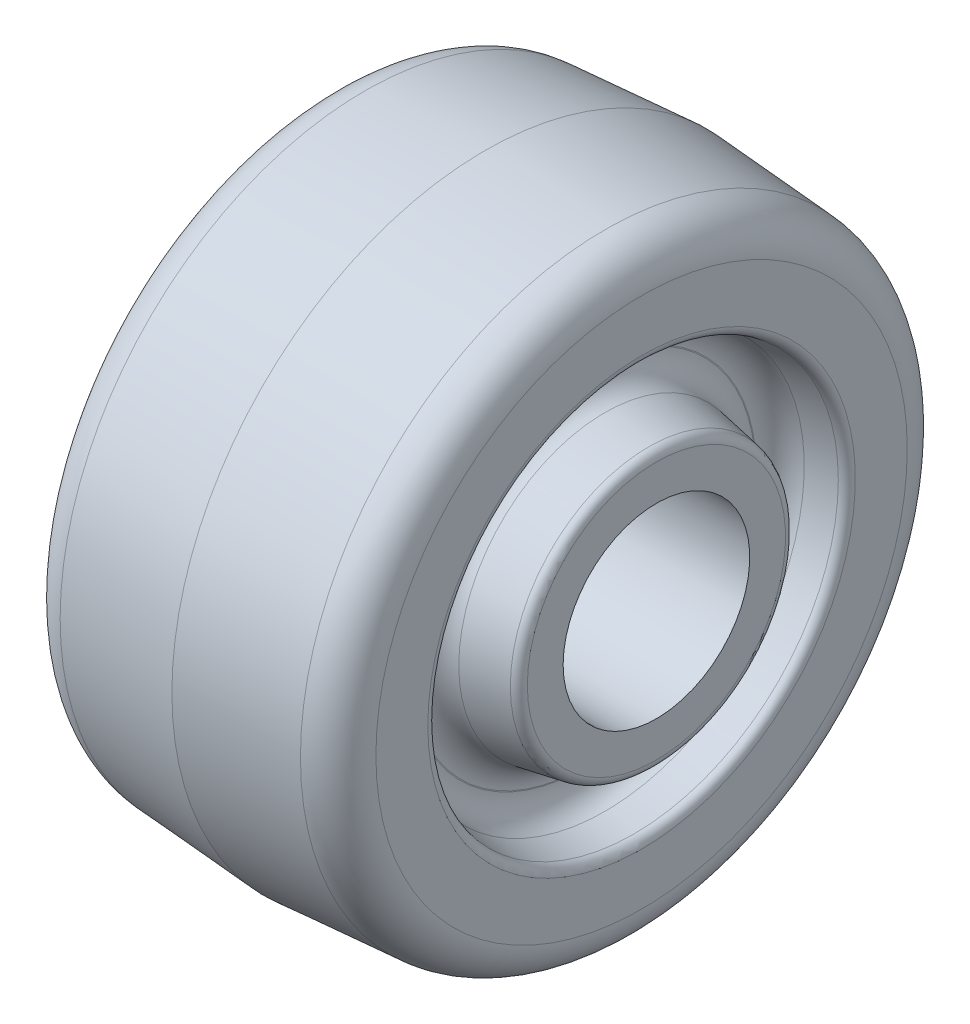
ISO-10303-21;
HEADER;
FILE_DESCRIPTION(('STEP AP214'),'2;1');
FILE_NAME('part.step','',(''),(''),'','','');
FILE_SCHEMA(('AUTOMOTIVE_DESIGN { 1 0 10303 214 1 1 1 1 }'));
ENDSEC;
DATA;
#1=APPLICATION_CONTEXT('core data for automotive mechanical design processes');
#2=APPLICATION_PROTOCOL_DEFINITION('international standard','automotive_design',2000,#1);
#3=PRODUCT_CONTEXT('',#1,'mechanical');
#4=PRODUCT('Part','Part','',(#3));
#5=PRODUCT_RELATED_PRODUCT_CATEGORY('part','',(#4));
#6=PRODUCT_DEFINITION_FORMATION('','',#4);
#7=PRODUCT_DEFINITION_CONTEXT('part definition',#1,'design');
#8=PRODUCT_DEFINITION('design','',#6,#7);
#9=PRODUCT_DEFINITION_SHAPE('','',#8);
#10=(LENGTH_UNIT() NAMED_UNIT(*) SI_UNIT(.MILLI.,.METRE.));
#11=(NAMED_UNIT(*) PLANE_ANGLE_UNIT() SI_UNIT($,.RADIAN.));
#12=(NAMED_UNIT(*) SI_UNIT($,.STERADIAN.) SOLID_ANGLE_UNIT());
#13=UNCERTAINTY_MEASURE_WITH_UNIT(LENGTH_MEASURE(1.E-05),#10,'distance_accuracy_value','');
#14=(GEOMETRIC_REPRESENTATION_CONTEXT(3) GLOBAL_UNCERTAINTY_ASSIGNED_CONTEXT((#13)) GLOBAL_UNIT_ASSIGNED_CONTEXT((#10,
#11,#12)) REPRESENTATION_CONTEXT('',''));
#15=CARTESIAN_POINT('',(0.,0.,0.));
#16=DIRECTION('',(0.,0.,1.));
#17=DIRECTION('',(1.,0.,0.));
#18=AXIS2_PLACEMENT_3D('',#15,#16,#17);
#19=CARTESIAN_POINT('',(0.,0.,0.));
#20=DIRECTION('',(1.,0.,0.));
#21=DIRECTION('',(0.,0.,-1.));
#22=AXIS2_PLACEMENT_3D('',#19,#20,#21);
#23=CONICAL_SURFACE('',#22,50.8,0.0698131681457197);
#24=CARTESIAN_POINT('',(-19.4929535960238,0.,0.));
#25=DIRECTION('',(-1.,0.,0.));
#26=DIRECTION('',(0.,0.,1.));
#27=AXIS2_PLACEMENT_3D('',#24,#25,#26);
#28=CIRCLE('',#27,49.436919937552);
#29=CARTESIAN_POINT('',(-19.4929535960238,0.,49.436919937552));
#30=VERTEX_POINT('',#29);
#31=EDGE_CURVE('E433',#30,#30,#28,.T.);
#32=ORIENTED_EDGE('',*,*,#31,.F.);
#33=EDGE_LOOP('',(#32));
#34=FACE_BOUND('',#33,.T.);
#35=CARTESIAN_POINT('',(0.,0.,0.));
#36=DIRECTION('',(-1.,0.,0.));
#37=DIRECTION('',(0.,0.,1.));
#38=AXIS2_PLACEMENT_3D('',#35,#36,#37);
#39=CIRCLE('',#38,50.8);
#40=CARTESIAN_POINT('',(0.,0.,50.8));
#41=VERTEX_POINT('',#40);
#42=EDGE_CURVE('E10',#41,#41,#39,.T.);
#43=ORIENTED_EDGE('',*,*,#42,.T.);
#44=EDGE_LOOP('',(#43));
#45=FACE_BOUND('',#44,.T.);
#46=ADVANCED_FACE('F360',(#34,#45),#23,.T.);
#47=CARTESIAN_POINT('',(19.4929535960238,0.,0.));
#48=DIRECTION('',(-1.,0.,0.));
#49=DIRECTION('',(0.,0.,1.));
#50=AXIS2_PLACEMENT_3D('',#47,#48,#49);
#51=CONICAL_SURFACE('',#50,49.436919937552,0.0698131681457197);
#52=ORIENTED_EDGE('',*,*,#42,.F.);
#53=EDGE_LOOP('',(#52));
#54=FACE_BOUND('',#53,.T.);
#55=CARTESIAN_POINT('',(19.4929535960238,0.,0.));
#56=DIRECTION('',(-1.,0.,0.));
#57=DIRECTION('',(0.,0.,1.));
#58=AXIS2_PLACEMENT_3D('',#55,#56,#57);
#59=CIRCLE('',#58,49.436919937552);
#60=CARTESIAN_POINT('',(19.4929535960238,0.,49.436919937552));
#61=VERTEX_POINT('',#60);
#62=EDGE_CURVE('E366',#61,#61,#59,.T.);
#63=ORIENTED_EDGE('',*,*,#62,.T.);
#64=EDGE_LOOP('',(#63));
#65=FACE_BOUND('',#64,.T.);
#66=ADVANCED_FACE('F440',(#54,#65),#51,.T.);
#67=CARTESIAN_POINT('',(19.05,0.,0.));
#68=DIRECTION('',(-1.,0.,0.));
#69=DIRECTION('',(0.,0.,1.));
#70=AXIS2_PLACEMENT_3D('',#67,#68,#69);
#71=TOROIDAL_SURFACE('',#70,43.1023882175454,6.35);
#72=ORIENTED_EDGE('',*,*,#62,.F.);
#73=EDGE_LOOP('',(#72));
#74=FACE_BOUND('',#73,.T.);
#75=CARTESIAN_POINT('',(25.4,0.,0.));
#76=DIRECTION('',(-1.,0.,0.));
#77=DIRECTION('',(0.,0.,1.));
#78=AXIS2_PLACEMENT_3D('',#75,#76,#77);
#79=CIRCLE('',#78,43.1023882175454);
#80=CARTESIAN_POINT('',(25.4,0.,43.1023882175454));
#81=VERTEX_POINT('',#80);
#82=EDGE_CURVE('E370',#81,#81,#79,.T.);
#83=ORIENTED_EDGE('',*,*,#82,.T.);
#84=EDGE_LOOP('',(#83));
#85=FACE_BOUND('',#84,.T.);
#86=ADVANCED_FACE('F444',(#74,#85),#71,.T.);
#87=CARTESIAN_POINT('',(25.4,43.1023882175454,0.));
#88=DIRECTION('',(-1.,0.,0.));
#89=DIRECTION('',(0.,0.,1.));
#90=AXIS2_PLACEMENT_3D('',#87,#88,#89);
#91=PLANE('',#90);
#92=ORIENTED_EDGE('',*,*,#82,.F.);
#93=EDGE_LOOP('',(#92));
#94=FACE_BOUND('',#93,.T.);
#95=CARTESIAN_POINT('',(25.4,0.,0.));
#96=DIRECTION('',(-1.,0.,0.));
#97=DIRECTION('',(0.,0.,1.));
#98=AXIS2_PLACEMENT_3D('',#95,#96,#97);
#99=CIRCLE('',#98,34.6797878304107);
#100=CARTESIAN_POINT('',(25.4,0.,34.6797878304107));
#101=VERTEX_POINT('',#100);
#102=EDGE_CURVE('E374',#101,#101,#99,.T.);
#103=ORIENTED_EDGE('',*,*,#102,.T.);
#104=EDGE_LOOP('',(#103));
#105=FACE_BOUND('',#104,.T.);
#106=ADVANCED_FACE('F449',(#94,#105),#91,.F.);
#107=CARTESIAN_POINT('',(23.876,0.,0.));
#108=DIRECTION('',(-1.,0.,0.));
#109=DIRECTION('',(0.,0.,1.));
#110=AXIS2_PLACEMENT_3D('',#107,#108,#109);
#111=TOROIDAL_SURFACE('',#110,34.6797878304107,1.524);
#112=ORIENTED_EDGE('',*,*,#102,.F.);
#113=EDGE_LOOP('',(#112));
#114=FACE_BOUND('',#113,.T.);
#115=CARTESIAN_POINT('',(24.1406398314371,0.,0.));
#116=DIRECTION('',(-1.,0.,0.));
#117=DIRECTION('',(0.,0.,1.));
#118=AXIS2_PLACEMENT_3D('',#115,#116,#117);
#119=CIRCLE('',#118,33.1789408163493);
#120=CARTESIAN_POINT('',(24.1406398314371,0.,33.1789408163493));
#121=VERTEX_POINT('',#120);
#122=EDGE_CURVE('E379',#121,#121,#119,.T.);
#123=ORIENTED_EDGE('',*,*,#122,.T.);
#124=EDGE_LOOP('',(#123));
#125=FACE_BOUND('',#124,.T.);
#126=ADVANCED_FACE('F455',(#114,#125),#111,.T.);
#127=CARTESIAN_POINT('',(19.4431871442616,0.,0.));
#128=DIRECTION('',(1.,0.,0.));
#129=DIRECTION('',(0.,0.,-1.));
#130=AXIS2_PLACEMENT_3D('',#127,#128,#129);
#131=CONICAL_SURFACE('',#130,32.3506531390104,0.174532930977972);
#132=ORIENTED_EDGE('',*,*,#122,.F.);
#133=EDGE_LOOP('',(#132));
#134=FACE_BOUND('',#133,.T.);
#135=CARTESIAN_POINT('',(19.4431871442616,0.,0.));
#136=DIRECTION('',(-1.,0.,0.));
#137=DIRECTION('',(0.,0.,1.));
#138=AXIS2_PLACEMENT_3D('',#135,#136,#137);
#139=CIRCLE('',#138,32.3506531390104);
#140=CARTESIAN_POINT('',(19.4431871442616,0.,32.3506531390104));
#141=VERTEX_POINT('',#140);
#142=EDGE_CURVE('E382',#141,#141,#139,.T.);
#143=ORIENTED_EDGE('',*,*,#142,.T.);
#144=EDGE_LOOP('',(#143));
#145=FACE_BOUND('',#144,.T.);
#146=ADVANCED_FACE('F459',(#134,#145),#131,.F.);
#147=CARTESIAN_POINT('',(20.193,0.,0.));
#148=DIRECTION('',(-1.,0.,0.));
#149=DIRECTION('',(0.,0.,1.));
#150=AXIS2_PLACEMENT_3D('',#147,#148,#149);
#151=TOROIDAL_SURFACE('',#150,28.0982532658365,4.318);
#152=ORIENTED_EDGE('',*,*,#142,.F.);
#153=EDGE_LOOP('',(#152));
#154=FACE_BOUND('',#153,.T.);
#155=CARTESIAN_POINT('',(15.875,0.,0.));
#156=DIRECTION('',(-1.,0.,0.));
#157=DIRECTION('',(0.,0.,1.));
#158=AXIS2_PLACEMENT_3D('',#155,#156,#157);
#159=CIRCLE('',#158,28.0982532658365);
#160=CARTESIAN_POINT('',(15.875,0.,28.0982532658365));
#161=VERTEX_POINT('',#160);
#162=EDGE_CURVE('E385',#161,#161,#159,.T.);
#163=ORIENTED_EDGE('',*,*,#162,.T.);
#164=EDGE_LOOP('',(#163));
#165=FACE_BOUND('',#164,.T.);
#166=ADVANCED_FACE('F463',(#154,#165),#151,.F.);
#167=CARTESIAN_POINT('',(15.875,28.0982532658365,0.));
#168=DIRECTION('',(-1.,0.,0.));
#169=DIRECTION('',(0.,0.,1.));
#170=AXIS2_PLACEMENT_3D('',#167,#168,#169);
#171=PLANE('',#170);
#172=ORIENTED_EDGE('',*,*,#162,.F.);
#173=EDGE_LOOP('',(#172));
#174=FACE_BOUND('',#173,.T.);
#175=CARTESIAN_POINT('',(15.875,0.,0.));
#176=DIRECTION('',(-1.,0.,0.));
#177=DIRECTION('',(0.,0.,1.));
#178=AXIS2_PLACEMENT_3D('',#175,#176,#177);
#179=CIRCLE('',#178,27.9532236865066);
#180=CARTESIAN_POINT('',(15.875,0.,27.9532236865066));
#181=VERTEX_POINT('',#180);
#182=EDGE_CURVE('E388',#181,#181,#179,.T.);
#183=ORIENTED_EDGE('',*,*,#182,.T.);
#184=EDGE_LOOP('',(#183));
#185=FACE_BOUND('',#184,.T.);
#186=ADVANCED_FACE('F467',(#174,#185),#171,.F.);
#187=CARTESIAN_POINT('',(20.193,0.,0.));
#188=DIRECTION('',(-1.,0.,0.));
#189=DIRECTION('',(0.,0.,1.));
#190=AXIS2_PLACEMENT_3D('',#187,#188,#189);
#191=TOROIDAL_SURFACE('',#190,27.9532236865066,4.318);
#192=ORIENTED_EDGE('',*,*,#182,.F.);
#193=EDGE_LOOP('',(#192));
#194=FACE_BOUND('',#193,.T.);
#195=CARTESIAN_POINT('',(19.443187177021,0.,0.));
#196=DIRECTION('',(-1.,0.,0.));
#197=DIRECTION('',(0.,0.,1.));
#198=AXIS2_PLACEMENT_3D('',#195,#196,#197);
#199=CIRCLE('',#198,23.7008238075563);
#200=CARTESIAN_POINT('',(19.443187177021,0.,23.7008238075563));
#201=VERTEX_POINT('',#200);
#202=EDGE_CURVE('E391',#201,#201,#199,.T.);
#203=ORIENTED_EDGE('',*,*,#202,.T.);
#204=EDGE_LOOP('',(#203));
#205=FACE_BOUND('',#204,.T.);
#206=ADVANCED_FACE('F471',(#194,#205),#191,.F.);
#207=CARTESIAN_POINT('',(26.553639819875,0.,0.));
#208=DIRECTION('',(-1.,0.,0.));
#209=DIRECTION('',(0.,0.,1.));
#210=AXIS2_PLACEMENT_3D('',#207,#208,#209);
#211=CONICAL_SURFACE('',#210,22.447059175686,0.174532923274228);
#212=ORIENTED_EDGE('',*,*,#202,.F.);
#213=EDGE_LOOP('',(#212));
#214=FACE_BOUND('',#213,.T.);
#215=CARTESIAN_POINT('',(26.553639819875,0.,0.));
#216=DIRECTION('',(-1.,0.,0.));
#217=DIRECTION('',(0.,0.,1.));
#218=AXIS2_PLACEMENT_3D('',#215,#216,#217);
#219=CIRCLE('',#218,22.447059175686);
#220=CARTESIAN_POINT('',(26.553639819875,0.,22.447059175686));
#221=VERTEX_POINT('',#220);
#222=EDGE_CURVE('E394',#221,#221,#219,.T.);
#223=ORIENTED_EDGE('',*,*,#222,.T.);
#224=EDGE_LOOP('',(#223));
#225=FACE_BOUND('',#224,.T.);
#226=ADVANCED_FACE('F475',(#214,#225),#211,.T.);
#227=CARTESIAN_POINT('',(26.289,0.,0.));
#228=DIRECTION('',(-1.,0.,0.));
#229=DIRECTION('',(0.,0.,1.));
#230=AXIS2_PLACEMENT_3D('',#227,#228,#229);
#231=TOROIDAL_SURFACE('',#230,20.9462121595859,1.524);
#232=ORIENTED_EDGE('',*,*,#222,.F.);
#233=EDGE_LOOP('',(#232));
#234=FACE_BOUND('',#233,.T.);
#235=CARTESIAN_POINT('',(27.813,0.,0.));
#236=DIRECTION('',(-1.,0.,0.));
#237=DIRECTION('',(0.,0.,1.));
#238=AXIS2_PLACEMENT_3D('',#235,#236,#237);
#239=CIRCLE('',#238,20.9462121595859);
#240=CARTESIAN_POINT('',(27.813,0.,20.9462121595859));
#241=VERTEX_POINT('',#240);
#242=EDGE_CURVE('E397',#241,#241,#239,.T.);
#243=ORIENTED_EDGE('',*,*,#242,.T.);
#244=EDGE_LOOP('',(#243));
#245=FACE_BOUND('',#244,.T.);
#246=ADVANCED_FACE('F479',(#234,#245),#231,.T.);
#247=CARTESIAN_POINT('',(27.813,20.9462121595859,0.));
#248=DIRECTION('',(-1.,0.,0.));
#249=DIRECTION('',(0.,0.,1.));
#250=AXIS2_PLACEMENT_3D('',#247,#248,#249);
#251=PLANE('',#250);
#252=ORIENTED_EDGE('',*,*,#242,.F.);
#253=EDGE_LOOP('',(#252));
#254=FACE_BOUND('',#253,.T.);
#255=CARTESIAN_POINT('',(27.813,0.,0.));
#256=DIRECTION('',(-1.,0.,0.));
#257=DIRECTION('',(0.,0.,1.));
#258=AXIS2_PLACEMENT_3D('',#255,#256,#257);
#259=CIRCLE('',#258,15.1384);
#260=CARTESIAN_POINT('',(27.813,0.,15.1384));
#261=VERTEX_POINT('',#260);
#262=EDGE_CURVE('E400',#261,#261,#259,.T.);
#263=ORIENTED_EDGE('',*,*,#262,.T.);
#264=EDGE_LOOP('',(#263));
#265=FACE_BOUND('',#264,.T.);
#266=ADVANCED_FACE('F483',(#254,#265),#251,.F.);
#267=CARTESIAN_POINT('',(-38.862204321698,0.,0.));
#268=DIRECTION('',(-1.,0.,0.));
#269=DIRECTION('',(0.,0.,1.));
#270=AXIS2_PLACEMENT_3D('',#267,#268,#269);
#271=CYLINDRICAL_SURFACE('',#270,15.1384);
#272=ORIENTED_EDGE('',*,*,#262,.F.);
#273=EDGE_LOOP('',(#272));
#274=FACE_BOUND('',#273,.T.);
#275=CARTESIAN_POINT('',(-27.813,0.,0.));
#276=DIRECTION('',(-1.,0.,0.));
#277=DIRECTION('',(0.,0.,1.));
#278=AXIS2_PLACEMENT_3D('',#275,#276,#277);
#279=CIRCLE('',#278,15.1384);
#280=CARTESIAN_POINT('',(-27.813,0.,15.1384));
#281=VERTEX_POINT('',#280);
#282=EDGE_CURVE('E403',#281,#281,#279,.T.);
#283=ORIENTED_EDGE('',*,*,#282,.T.);
#284=EDGE_LOOP('',(#283));
#285=FACE_BOUND('',#284,.T.);
#286=ADVANCED_FACE('F487',(#274,#285),#271,.F.);
#287=CARTESIAN_POINT('',(-27.813,15.1384,0.));
#288=DIRECTION('',(1.,0.,0.));
#289=DIRECTION('',(0.,0.,-1.));
#290=AXIS2_PLACEMENT_3D('',#287,#288,#289);
#291=PLANE('',#290);
#292=ORIENTED_EDGE('',*,*,#282,.F.);
#293=EDGE_LOOP('',(#292));
#294=FACE_BOUND('',#293,.T.);
#295=CARTESIAN_POINT('',(-27.813,0.,0.));
#296=DIRECTION('',(-1.,0.,0.));
#297=DIRECTION('',(0.,0.,1.));
#298=AXIS2_PLACEMENT_3D('',#295,#296,#297);
#299=CIRCLE('',#298,20.9462121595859);
#300=CARTESIAN_POINT('',(-27.813,0.,20.9462121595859));
#301=VERTEX_POINT('',#300);
#302=EDGE_CURVE('E406',#301,#301,#299,.T.);
#303=ORIENTED_EDGE('',*,*,#302,.T.);
#304=EDGE_LOOP('',(#303));
#305=FACE_BOUND('',#304,.T.);
#306=ADVANCED_FACE('F491',(#294,#305),#291,.F.);
#307=CARTESIAN_POINT('',(-26.289,0.,0.));
#308=DIRECTION('',(-1.,0.,0.));
#309=DIRECTION('',(0.,0.,1.));
#310=AXIS2_PLACEMENT_3D('',#307,#308,#309);
#311=TOROIDAL_SURFACE('',#310,20.9462121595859,1.524);
#312=ORIENTED_EDGE('',*,*,#302,.F.);
#313=EDGE_LOOP('',(#312));
#314=FACE_BOUND('',#313,.T.);
#315=CARTESIAN_POINT('',(-26.553639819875,0.,0.));
#316=DIRECTION('',(-1.,0.,0.));
#317=DIRECTION('',(0.,0.,1.));
#318=AXIS2_PLACEMENT_3D('',#315,#316,#317);
#319=CIRCLE('',#318,22.447059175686);
#320=CARTESIAN_POINT('',(-26.553639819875,0.,22.447059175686));
#321=VERTEX_POINT('',#320);
#322=EDGE_CURVE('E409',#321,#321,#319,.T.);
#323=ORIENTED_EDGE('',*,*,#322,.T.);
#324=EDGE_LOOP('',(#323));
#325=FACE_BOUND('',#324,.T.);
#326=ADVANCED_FACE('F495',(#314,#325),#311,.T.);
#327=CARTESIAN_POINT('',(-19.443187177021,0.,0.));
#328=DIRECTION('',(1.,0.,0.));
#329=DIRECTION('',(0.,0.,-1.));
#330=AXIS2_PLACEMENT_3D('',#327,#328,#329);
#331=CONICAL_SURFACE('',#330,23.7008238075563,0.174532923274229);
#332=ORIENTED_EDGE('',*,*,#322,.F.);
#333=EDGE_LOOP('',(#332));
#334=FACE_BOUND('',#333,.T.);
#335=CARTESIAN_POINT('',(-19.443187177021,0.,0.));
#336=DIRECTION('',(-1.,0.,0.));
#337=DIRECTION('',(0.,0.,1.));
#338=AXIS2_PLACEMENT_3D('',#335,#336,#337);
#339=CIRCLE('',#338,23.7008238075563);
#340=CARTESIAN_POINT('',(-19.443187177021,0.,23.7008238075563));
#341=VERTEX_POINT('',#340);
#342=EDGE_CURVE('E412',#341,#341,#339,.T.);
#343=ORIENTED_EDGE('',*,*,#342,.T.);
#344=EDGE_LOOP('',(#343));
#345=FACE_BOUND('',#344,.T.);
#346=ADVANCED_FACE('F499',(#334,#345),#331,.T.);
#347=CARTESIAN_POINT('',(-20.193,0.,0.));
#348=DIRECTION('',(-1.,0.,0.));
#349=DIRECTION('',(0.,0.,1.));
#350=AXIS2_PLACEMENT_3D('',#347,#348,#349);
#351=TOROIDAL_SURFACE('',#350,27.9532236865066,4.318);
#352=ORIENTED_EDGE('',*,*,#342,.F.);
#353=EDGE_LOOP('',(#352));
#354=FACE_BOUND('',#353,.T.);
#355=CARTESIAN_POINT('',(-15.875,0.,0.));
#356=DIRECTION('',(-1.,0.,0.));
#357=DIRECTION('',(0.,0.,1.));
#358=AXIS2_PLACEMENT_3D('',#355,#356,#357);
#359=CIRCLE('',#358,27.9532236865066);
#360=CARTESIAN_POINT('',(-15.875,0.,27.9532236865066));
#361=VERTEX_POINT('',#360);
#362=EDGE_CURVE('E415',#361,#361,#359,.T.);
#363=ORIENTED_EDGE('',*,*,#362,.T.);
#364=EDGE_LOOP('',(#363));
#365=FACE_BOUND('',#364,.T.);
#366=ADVANCED_FACE('F503',(#354,#365),#351,.F.);
#367=CARTESIAN_POINT('',(-15.875,27.9532236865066,0.));
#368=DIRECTION('',(1.,0.,0.));
#369=DIRECTION('',(0.,0.,-1.));
#370=AXIS2_PLACEMENT_3D('',#367,#368,#369);
#371=PLANE('',#370);
#372=ORIENTED_EDGE('',*,*,#362,.F.);
#373=EDGE_LOOP('',(#372));
#374=FACE_BOUND('',#373,.T.);
#375=CARTESIAN_POINT('',(-15.875,0.,0.));
#376=DIRECTION('',(-1.,0.,0.));
#377=DIRECTION('',(0.,0.,1.));
#378=AXIS2_PLACEMENT_3D('',#375,#376,#377);
#379=CIRCLE('',#378,28.0982532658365);
#380=CARTESIAN_POINT('',(-15.875,0.,28.0982532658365));
#381=VERTEX_POINT('',#380);
#382=EDGE_CURVE('E418',#381,#381,#379,.T.);
#383=ORIENTED_EDGE('',*,*,#382,.T.);
#384=EDGE_LOOP('',(#383));
#385=FACE_BOUND('',#384,.T.);
#386=ADVANCED_FACE('F507',(#374,#385),#371,.F.);
#387=CARTESIAN_POINT('',(-20.193,0.,0.));
#388=DIRECTION('',(-1.,0.,0.));
#389=DIRECTION('',(0.,0.,1.));
#390=AXIS2_PLACEMENT_3D('',#387,#388,#389);
#391=TOROIDAL_SURFACE('',#390,28.0982532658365,4.318);
#392=ORIENTED_EDGE('',*,*,#382,.F.);
#393=EDGE_LOOP('',(#392));
#394=FACE_BOUND('',#393,.T.);
#395=CARTESIAN_POINT('',(-19.4431871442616,0.,0.));
#396=DIRECTION('',(-1.,0.,0.));
#397=DIRECTION('',(0.,0.,1.));
#398=AXIS2_PLACEMENT_3D('',#395,#396,#397);
#399=CIRCLE('',#398,32.3506531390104);
#400=CARTESIAN_POINT('',(-19.4431871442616,0.,32.3506531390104));
#401=VERTEX_POINT('',#400);
#402=EDGE_CURVE('E421',#401,#401,#399,.T.);
#403=ORIENTED_EDGE('',*,*,#402,.T.);
#404=EDGE_LOOP('',(#403));
#405=FACE_BOUND('',#404,.T.);
#406=ADVANCED_FACE('F511',(#394,#405),#391,.F.);
#407=CARTESIAN_POINT('',(-24.1406398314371,0.,0.));
#408=DIRECTION('',(-1.,0.,0.));
#409=DIRECTION('',(0.,0.,1.));
#410=AXIS2_PLACEMENT_3D('',#407,#408,#409);
#411=CONICAL_SURFACE('',#410,33.1789408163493,0.174532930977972);
#412=ORIENTED_EDGE('',*,*,#402,.F.);
#413=EDGE_LOOP('',(#412));
#414=FACE_BOUND('',#413,.T.);
#415=CARTESIAN_POINT('',(-24.1406398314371,0.,0.));
#416=DIRECTION('',(-1.,0.,0.));
#417=DIRECTION('',(0.,0.,1.));
#418=AXIS2_PLACEMENT_3D('',#415,#416,#417);
#419=CIRCLE('',#418,33.1789408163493);
#420=CARTESIAN_POINT('',(-24.1406398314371,0.,33.1789408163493));
#421=VERTEX_POINT('',#420);
#422=EDGE_CURVE('E424',#421,#421,#419,.T.);
#423=ORIENTED_EDGE('',*,*,#422,.T.);
#424=EDGE_LOOP('',(#423));
#425=FACE_BOUND('',#424,.T.);
#426=ADVANCED_FACE('F515',(#414,#425),#411,.F.);
#427=CARTESIAN_POINT('',(-23.876,0.,0.));
#428=DIRECTION('',(-1.,0.,0.));
#429=DIRECTION('',(0.,0.,1.));
#430=AXIS2_PLACEMENT_3D('',#427,#428,#429);
#431=TOROIDAL_SURFACE('',#430,34.6797878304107,1.524);
#432=ORIENTED_EDGE('',*,*,#422,.F.);
#433=EDGE_LOOP('',(#432));
#434=FACE_BOUND('',#433,.T.);
#435=CARTESIAN_POINT('',(-25.4,0.,0.));
#436=DIRECTION('',(-1.,0.,0.));
#437=DIRECTION('',(0.,0.,1.));
#438=AXIS2_PLACEMENT_3D('',#435,#436,#437);
#439=CIRCLE('',#438,34.6797878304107);
#440=CARTESIAN_POINT('',(-25.4,0.,34.6797878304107));
#441=VERTEX_POINT('',#440);
#442=EDGE_CURVE('E427',#441,#441,#439,.T.);
#443=ORIENTED_EDGE('',*,*,#442,.T.);
#444=EDGE_LOOP('',(#443));
#445=FACE_BOUND('',#444,.T.);
#446=ADVANCED_FACE('F519',(#434,#445),#431,.T.);
#447=CARTESIAN_POINT('',(-25.4,34.6797878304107,0.));
#448=DIRECTION('',(1.,0.,0.));
#449=DIRECTION('',(0.,0.,-1.));
#450=AXIS2_PLACEMENT_3D('',#447,#448,#449);
#451=PLANE('',#450);
#452=ORIENTED_EDGE('',*,*,#442,.F.);
#453=EDGE_LOOP('',(#452));
#454=FACE_BOUND('',#453,.T.);
#455=CARTESIAN_POINT('',(-25.4,0.,0.));
#456=DIRECTION('',(-1.,0.,0.));
#457=DIRECTION('',(0.,0.,1.));
#458=AXIS2_PLACEMENT_3D('',#455,#456,#457);
#459=CIRCLE('',#458,43.1023882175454);
#460=CARTESIAN_POINT('',(-25.4,0.,43.1023882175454));
#461=VERTEX_POINT('',#460);
#462=EDGE_CURVE('E430',#461,#461,#459,.T.);
#463=ORIENTED_EDGE('',*,*,#462,.T.);
#464=EDGE_LOOP('',(#463));
#465=FACE_BOUND('',#464,.T.);
#466=ADVANCED_FACE('F523',(#454,#465),#451,.F.);
#467=CARTESIAN_POINT('',(-19.05,0.,0.));
#468=DIRECTION('',(-1.,0.,0.));
#469=DIRECTION('',(0.,0.,1.));
#470=AXIS2_PLACEMENT_3D('',#467,#468,#469);
#471=TOROIDAL_SURFACE('',#470,43.1023882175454,6.35);
#472=ORIENTED_EDGE('',*,*,#462,.F.);
#473=EDGE_LOOP('',(#472));
#474=FACE_BOUND('',#473,.T.);
#475=ORIENTED_EDGE('',*,*,#31,.T.);
#476=EDGE_LOOP('',(#475));
#477=FACE_BOUND('',#476,.T.);
#478=ADVANCED_FACE('F437',(#474,#477),#471,.T.);
#479=CLOSED_SHELL('',(#46,#66,#86,#106,#126,#146,#166,#186,#206,#226,#246,#266,#286,#306,#326,
#346,#366,#386,#406,#426,#446,#466,#478));
#480=MANIFOLD_SOLID_BREP('B2',#479);
#481=ADVANCED_BREP_SHAPE_REPRESENTATION('',(#18,#480),#14);
#482=SHAPE_DEFINITION_REPRESENTATION(#9,#481);
ENDSEC;
END-ISO-10303-21;
